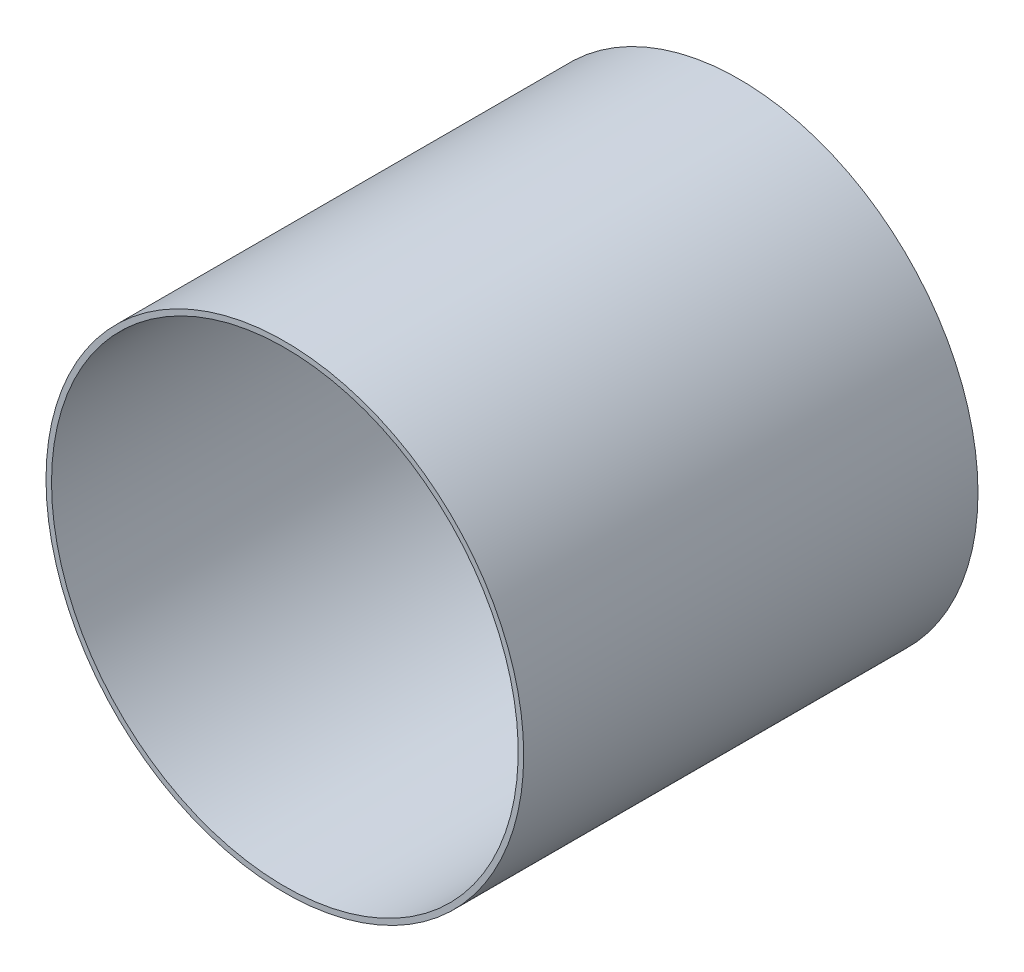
ISO-10303-21;
HEADER;
FILE_DESCRIPTION(('STEP AP214'),'2;1');
FILE_NAME('part.step','',(''),(''),'','','');
FILE_SCHEMA(('AUTOMOTIVE_DESIGN { 1 0 10303 214 1 1 1 1 }'));
ENDSEC;
DATA;
#1=APPLICATION_CONTEXT('core data for automotive mechanical design processes');
#2=APPLICATION_PROTOCOL_DEFINITION('international standard','automotive_design',2000,#1);
#3=PRODUCT_CONTEXT('',#1,'mechanical');
#4=PRODUCT('Part','Part','',(#3));
#5=PRODUCT_RELATED_PRODUCT_CATEGORY('part','',(#4));
#6=PRODUCT_DEFINITION_FORMATION('','',#4);
#7=PRODUCT_DEFINITION_CONTEXT('part definition',#1,'design');
#8=PRODUCT_DEFINITION('design','',#6,#7);
#9=PRODUCT_DEFINITION_SHAPE('','',#8);
#10=(LENGTH_UNIT() NAMED_UNIT(*) SI_UNIT(.MILLI.,.METRE.));
#11=(NAMED_UNIT(*) PLANE_ANGLE_UNIT() SI_UNIT($,.RADIAN.));
#12=(NAMED_UNIT(*) SI_UNIT($,.STERADIAN.) SOLID_ANGLE_UNIT());
#13=UNCERTAINTY_MEASURE_WITH_UNIT(LENGTH_MEASURE(1.E-05),#10,'distance_accuracy_value','');
#14=(GEOMETRIC_REPRESENTATION_CONTEXT(3) GLOBAL_UNCERTAINTY_ASSIGNED_CONTEXT((#13)) GLOBAL_UNIT_ASSIGNED_CONTEXT((#10,
#11,#12)) REPRESENTATION_CONTEXT('',''));
#15=CARTESIAN_POINT('',(0.,0.,0.));
#16=DIRECTION('',(0.,0.,1.));
#17=DIRECTION('',(1.,0.,0.));
#18=AXIS2_PLACEMENT_3D('',#15,#16,#17);
#19=CARTESIAN_POINT('',(0.,0.,16.5));
#20=DIRECTION('',(0.,0.,-1.));
#21=DIRECTION('',(-1.,0.,0.));
#22=AXIS2_PLACEMENT_3D('',#19,#20,#21);
#23=CYLINDRICAL_SURFACE('',#22,8.475);
#24=CARTESIAN_POINT('',(0.,0.,16.5));
#25=DIRECTION('',(0.,0.,-1.));
#26=DIRECTION('',(-1.,0.,0.));
#27=AXIS2_PLACEMENT_3D('',#24,#25,#26);
#28=CIRCLE('',#27,8.475);
#29=CARTESIAN_POINT('',(-8.475,0.,16.5));
#30=VERTEX_POINT('',#29);
#31=EDGE_CURVE('E18',#30,#30,#28,.T.);
#32=ORIENTED_EDGE('',*,*,#31,.F.);
#33=EDGE_LOOP('',(#32));
#34=FACE_BOUND('',#33,.T.);
#35=CARTESIAN_POINT('',(0.,0.,0.));
#36=DIRECTION('',(0.,0.,-1.));
#37=DIRECTION('',(-1.,0.,0.));
#38=AXIS2_PLACEMENT_3D('',#35,#36,#37);
#39=CIRCLE('',#38,8.475);
#40=CARTESIAN_POINT('',(-8.475,0.,0.));
#41=VERTEX_POINT('',#40);
#42=EDGE_CURVE('E30',#41,#41,#39,.F.);
#43=ORIENTED_EDGE('',*,*,#42,.F.);
#44=EDGE_LOOP('',(#43));
#45=FACE_BOUND('',#44,.T.);
#46=ADVANCED_FACE('F15',(#34,#45),#23,.F.);
#47=CARTESIAN_POINT('',(0.,0.,16.5));
#48=DIRECTION('',(0.,0.,1.));
#49=DIRECTION('',(1.,0.,0.));
#50=AXIS2_PLACEMENT_3D('',#47,#48,#49);
#51=PLANE('',#50);
#52=CARTESIAN_POINT('',(0.,0.,16.5));
#53=DIRECTION('',(0.,0.,1.));
#54=DIRECTION('',(1.,0.,0.));
#55=AXIS2_PLACEMENT_3D('',#52,#53,#54);
#56=CIRCLE('',#55,8.675);
#57=CARTESIAN_POINT('',(8.675,0.,16.5));
#58=VERTEX_POINT('',#57);
#59=EDGE_CURVE('E23',#58,#58,#56,.F.);
#60=ORIENTED_EDGE('',*,*,#59,.F.);
#61=EDGE_LOOP('',(#60));
#62=FACE_BOUND('',#61,.T.);
#63=ORIENTED_EDGE('',*,*,#31,.T.);
#64=EDGE_LOOP('',(#63));
#65=FACE_BOUND('',#64,.T.);
#66=ADVANCED_FACE('F38',(#62,#65),#51,.T.);
#67=CARTESIAN_POINT('',(0.,0.,0.));
#68=DIRECTION('',(0.,0.,-1.));
#69=DIRECTION('',(-1.,0.,0.));
#70=AXIS2_PLACEMENT_3D('',#67,#68,#69);
#71=PLANE('',#70);
#72=CARTESIAN_POINT('',(0.,0.,0.));
#73=DIRECTION('',(0.,0.,1.));
#74=DIRECTION('',(1.,0.,0.));
#75=AXIS2_PLACEMENT_3D('',#72,#73,#74);
#76=CIRCLE('',#75,8.675);
#77=CARTESIAN_POINT('',(8.675,0.,0.));
#78=VERTEX_POINT('',#77);
#79=EDGE_CURVE('E10',#78,#78,#76,.T.);
#80=ORIENTED_EDGE('',*,*,#79,.F.);
#81=EDGE_LOOP('',(#80));
#82=FACE_BOUND('',#81,.T.);
#83=ORIENTED_EDGE('',*,*,#42,.T.);
#84=EDGE_LOOP('',(#83));
#85=FACE_BOUND('',#84,.T.);
#86=ADVANCED_FACE('F46',(#82,#85),#71,.T.);
#87=CARTESIAN_POINT('',(0.,0.,0.));
#88=DIRECTION('',(0.,0.,1.));
#89=DIRECTION('',(1.,0.,0.));
#90=AXIS2_PLACEMENT_3D('',#87,#88,#89);
#91=CYLINDRICAL_SURFACE('',#90,8.675);
#92=ORIENTED_EDGE('',*,*,#79,.T.);
#93=EDGE_LOOP('',(#92));
#94=FACE_BOUND('',#93,.T.);
#95=ORIENTED_EDGE('',*,*,#59,.T.);
#96=EDGE_LOOP('',(#95));
#97=FACE_BOUND('',#96,.T.);
#98=ADVANCED_FACE('F48',(#94,#97),#91,.T.);
#99=CLOSED_SHELL('',(#46,#66,#86,#98));
#100=MANIFOLD_SOLID_BREP('B1',#99);
#101=ADVANCED_BREP_SHAPE_REPRESENTATION('',(#18,#100),#14);
#102=SHAPE_DEFINITION_REPRESENTATION(#9,#101);
ENDSEC;
END-ISO-10303-21;
